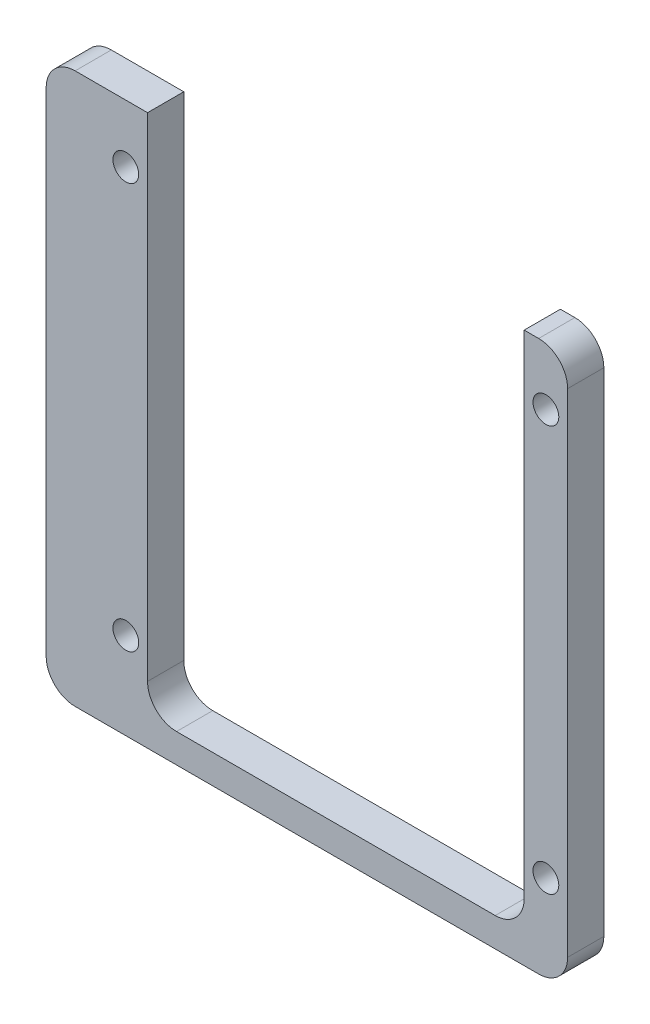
ISO-10303-21;
HEADER;
FILE_DESCRIPTION(('STEP AP214'),'2;1');
FILE_NAME('part.step','',(''),(''),'','','');
FILE_SCHEMA(('AUTOMOTIVE_DESIGN { 1 0 10303 214 1 1 1 1 }'));
ENDSEC;
DATA;
#1=APPLICATION_CONTEXT('core data for automotive mechanical design processes');
#2=APPLICATION_PROTOCOL_DEFINITION('international standard','automotive_design',2000,#1);
#3=PRODUCT_CONTEXT('',#1,'mechanical');
#4=PRODUCT('Part','Part','',(#3));
#5=PRODUCT_RELATED_PRODUCT_CATEGORY('part','',(#4));
#6=PRODUCT_DEFINITION_FORMATION('','',#4);
#7=PRODUCT_DEFINITION_CONTEXT('part definition',#1,'design');
#8=PRODUCT_DEFINITION('design','',#6,#7);
#9=PRODUCT_DEFINITION_SHAPE('','',#8);
#10=(LENGTH_UNIT() NAMED_UNIT(*) SI_UNIT(.MILLI.,.METRE.));
#11=(NAMED_UNIT(*) PLANE_ANGLE_UNIT() SI_UNIT($,.RADIAN.));
#12=(NAMED_UNIT(*) SI_UNIT($,.STERADIAN.) SOLID_ANGLE_UNIT());
#13=UNCERTAINTY_MEASURE_WITH_UNIT(LENGTH_MEASURE(1.E-05),#10,'distance_accuracy_value','');
#14=(GEOMETRIC_REPRESENTATION_CONTEXT(3) GLOBAL_UNCERTAINTY_ASSIGNED_CONTEXT((#13)) GLOBAL_UNIT_ASSIGNED_CONTEXT((#10,
#11,#12)) REPRESENTATION_CONTEXT('',''));
#15=CARTESIAN_POINT('',(0.,0.,0.));
#16=DIRECTION('',(0.,0.,1.));
#17=DIRECTION('',(1.,0.,0.));
#18=AXIS2_PLACEMENT_3D('',#15,#16,#17);
#19=CARTESIAN_POINT('',(-22.86,24.13,3.175));
#20=DIRECTION('',(0.,-1.,0.));
#21=DIRECTION('',(0.,0.,-1.));
#22=AXIS2_PLACEMENT_3D('',#19,#20,#21);
#23=PLANE('',#22);
#24=DIRECTION('',(-1.,0.,0.));
#25=VECTOR('',#24,1.);
#26=CARTESIAN_POINT('',(-22.86,24.13,3.175));
#27=LINE('',#26,#25);
#28=CARTESIAN_POINT('',(20.32,24.13,3.175));
#29=VERTEX_POINT('',#28);
#30=CARTESIAN_POINT('',(19.05,24.13,3.175));
#31=VERTEX_POINT('',#30);
#32=EDGE_CURVE('E191',#29,#31,#27,.T.);
#33=ORIENTED_EDGE('',*,*,#32,.F.);
#34=DIRECTION('',(0.,0.,-1.));
#35=VECTOR('',#34,1.);
#36=CARTESIAN_POINT('',(20.32,24.13,3.175));
#37=LINE('',#36,#35);
#38=CARTESIAN_POINT('',(20.32,24.13,0.));
#39=VERTEX_POINT('',#38);
#40=EDGE_CURVE('E151',#29,#39,#37,.T.);
#41=ORIENTED_EDGE('',*,*,#40,.T.);
#42=DIRECTION('',(-1.,0.,0.));
#43=VECTOR('',#42,1.);
#44=CARTESIAN_POINT('',(-22.86,24.13,0.));
#45=LINE('',#44,#43);
#46=CARTESIAN_POINT('',(19.05,24.13,0.));
#47=VERTEX_POINT('',#46);
#48=EDGE_CURVE('E146',#39,#47,#45,.T.);
#49=ORIENTED_EDGE('',*,*,#48,.T.);
#50=DIRECTION('',(0.,0.,1.));
#51=VECTOR('',#50,1.);
#52=CARTESIAN_POINT('',(19.05,24.13,0.));
#53=LINE('',#52,#51);
#54=EDGE_CURVE('E149',#47,#31,#53,.T.);
#55=ORIENTED_EDGE('',*,*,#54,.T.);
#56=EDGE_LOOP('',(#33,#41,#49,#55));
#57=FACE_BOUND('',#56,.T.);
#58=ADVANCED_FACE('F41',(#57),#23,.F.);
#59=CARTESIAN_POINT('',(22.86,24.13,3.175));
#60=DIRECTION('',(-1.,0.,0.));
#61=DIRECTION('',(0.,-1.,0.));
#62=AXIS2_PLACEMENT_3D('',#59,#60,#61);
#63=PLANE('',#62);
#64=DIRECTION('',(0.,1.,0.));
#65=VECTOR('',#64,1.);
#66=CARTESIAN_POINT('',(22.86,24.13,3.175));
#67=LINE('',#66,#65);
#68=CARTESIAN_POINT('',(22.86,-21.59,3.175));
#69=VERTEX_POINT('',#68);
#70=CARTESIAN_POINT('',(22.86,21.59,3.175));
#71=VERTEX_POINT('',#70);
#72=EDGE_CURVE('E186',#69,#71,#67,.T.);
#73=ORIENTED_EDGE('',*,*,#72,.F.);
#74=DIRECTION('',(0.,0.,-1.));
#75=VECTOR('',#74,1.);
#76=CARTESIAN_POINT('',(22.86,-21.59,3.175));
#77=LINE('',#76,#75);
#78=CARTESIAN_POINT('',(22.86,-21.59,0.));
#79=VERTEX_POINT('',#78);
#80=EDGE_CURVE('E212',#69,#79,#77,.T.);
#81=ORIENTED_EDGE('',*,*,#80,.T.);
#82=DIRECTION('',(0.,1.,0.));
#83=VECTOR('',#82,1.);
#84=CARTESIAN_POINT('',(22.86,24.13,0.));
#85=LINE('',#84,#83);
#86=CARTESIAN_POINT('',(22.86,21.59,0.));
#87=VERTEX_POINT('',#86);
#88=EDGE_CURVE('E181',#79,#87,#85,.T.);
#89=ORIENTED_EDGE('',*,*,#88,.T.);
#90=DIRECTION('',(0.,0.,-1.));
#91=VECTOR('',#90,1.);
#92=CARTESIAN_POINT('',(22.86,21.59,3.175));
#93=LINE('',#92,#91);
#94=EDGE_CURVE('E201',#87,#71,#93,.F.);
#95=ORIENTED_EDGE('',*,*,#94,.T.);
#96=EDGE_LOOP('',(#73,#81,#89,#95));
#97=FACE_BOUND('',#96,.T.);
#98=ADVANCED_FACE('F367',(#97),#63,.F.);
#99=CARTESIAN_POINT('',(-13.97,24.13,0.));
#100=VERTEX_POINT('',#99);
#101=CARTESIAN_POINT('',(-20.32,24.13,0.));
#102=VERTEX_POINT('',#101);
#103=EDGE_CURVE('E155',#100,#102,#45,.T.);
#104=ORIENTED_EDGE('',*,*,#103,.T.);
#105=DIRECTION('',(0.,0.,-1.));
#106=VECTOR('',#105,1.);
#107=CARTESIAN_POINT('',(-20.32,24.13,3.175));
#108=LINE('',#107,#106);
#109=CARTESIAN_POINT('',(-20.32,24.13,3.175));
#110=VERTEX_POINT('',#109);
#111=EDGE_CURVE('E252',#102,#110,#108,.F.);
#112=ORIENTED_EDGE('',*,*,#111,.T.);
#113=CARTESIAN_POINT('',(-13.97,24.13,3.175));
#114=VERTEX_POINT('',#113);
#115=EDGE_CURVE('E189',#114,#110,#27,.T.);
#116=ORIENTED_EDGE('',*,*,#115,.F.);
#117=DIRECTION('',(0.,0.,1.));
#118=VECTOR('',#117,1.);
#119=CARTESIAN_POINT('',(-13.97,24.13,0.));
#120=LINE('',#119,#118);
#121=EDGE_CURVE('E176',#100,#114,#120,.T.);
#122=ORIENTED_EDGE('',*,*,#121,.F.);
#123=EDGE_LOOP('',(#104,#112,#116,#122));
#124=FACE_BOUND('',#123,.T.);
#125=ADVANCED_FACE('F369',(#124),#23,.F.);
#126=CARTESIAN_POINT('',(-22.86,24.13,3.175));
#127=DIRECTION('',(1.,0.,0.));
#128=DIRECTION('',(0.,1.,0.));
#129=AXIS2_PLACEMENT_3D('',#126,#127,#128);
#130=PLANE('',#129);
#131=DIRECTION('',(0.,-1.,0.));
#132=VECTOR('',#131,1.);
#133=CARTESIAN_POINT('',(-22.86,24.13,0.));
#134=LINE('',#133,#132);
#135=CARTESIAN_POINT('',(-22.86,21.59,0.));
#136=VERTEX_POINT('',#135);
#137=CARTESIAN_POINT('',(-22.86,-21.59,0.));
#138=VERTEX_POINT('',#137);
#139=EDGE_CURVE('E154',#136,#138,#134,.T.);
#140=ORIENTED_EDGE('',*,*,#139,.T.);
#141=DIRECTION('',(0.,0.,-1.));
#142=VECTOR('',#141,1.);
#143=CARTESIAN_POINT('',(-22.86,-21.59,3.175));
#144=LINE('',#143,#142);
#145=CARTESIAN_POINT('',(-22.86,-21.59,3.175));
#146=VERTEX_POINT('',#145);
#147=EDGE_CURVE('E65',#138,#146,#144,.F.);
#148=ORIENTED_EDGE('',*,*,#147,.T.);
#149=DIRECTION('',(0.,-1.,0.));
#150=VECTOR('',#149,1.);
#151=CARTESIAN_POINT('',(-22.86,24.13,3.175));
#152=LINE('',#151,#150);
#153=CARTESIAN_POINT('',(-22.86,21.59,3.175));
#154=VERTEX_POINT('',#153);
#155=EDGE_CURVE('E194',#154,#146,#152,.T.);
#156=ORIENTED_EDGE('',*,*,#155,.F.);
#157=DIRECTION('',(0.,0.,-1.));
#158=VECTOR('',#157,1.);
#159=CARTESIAN_POINT('',(-22.86,21.59,3.175));
#160=LINE('',#159,#158);
#161=EDGE_CURVE('E246',#154,#136,#160,.T.);
#162=ORIENTED_EDGE('',*,*,#161,.T.);
#163=EDGE_LOOP('',(#140,#148,#156,#162));
#164=FACE_BOUND('',#163,.T.);
#165=ADVANCED_FACE('F377',(#164),#130,.F.);
#166=CARTESIAN_POINT('',(-22.86,-24.13,3.175));
#167=DIRECTION('',(0.,1.,0.));
#168=DIRECTION('',(0.,0.,1.));
#169=AXIS2_PLACEMENT_3D('',#166,#167,#168);
#170=PLANE('',#169);
#171=DIRECTION('',(1.,0.,0.));
#172=VECTOR('',#171,1.);
#173=CARTESIAN_POINT('',(-22.86,-24.13,0.));
#174=LINE('',#173,#172);
#175=CARTESIAN_POINT('',(-20.32,-24.13,0.));
#176=VERTEX_POINT('',#175);
#177=CARTESIAN_POINT('',(20.32,-24.13,0.));
#178=VERTEX_POINT('',#177);
#179=EDGE_CURVE('E190',#176,#178,#174,.T.);
#180=ORIENTED_EDGE('',*,*,#179,.T.);
#181=DIRECTION('',(0.,0.,-1.));
#182=VECTOR('',#181,1.);
#183=CARTESIAN_POINT('',(20.32,-24.13,3.175));
#184=LINE('',#183,#182);
#185=CARTESIAN_POINT('',(20.32,-24.13,3.175));
#186=VERTEX_POINT('',#185);
#187=EDGE_CURVE('E232',#178,#186,#184,.F.);
#188=ORIENTED_EDGE('',*,*,#187,.T.);
#189=DIRECTION('',(1.,0.,0.));
#190=VECTOR('',#189,1.);
#191=CARTESIAN_POINT('',(-22.86,-24.13,3.175));
#192=LINE('',#191,#190);
#193=CARTESIAN_POINT('',(-20.32,-24.13,3.175));
#194=VERTEX_POINT('',#193);
#195=EDGE_CURVE('E197',#194,#186,#192,.T.);
#196=ORIENTED_EDGE('',*,*,#195,.F.);
#197=DIRECTION('',(0.,0.,-1.));
#198=VECTOR('',#197,1.);
#199=CARTESIAN_POINT('',(-20.32,-24.13,3.175));
#200=LINE('',#199,#198);
#201=EDGE_CURVE('E228',#194,#176,#200,.T.);
#202=ORIENTED_EDGE('',*,*,#201,.T.);
#203=EDGE_LOOP('',(#180,#188,#196,#202));
#204=FACE_BOUND('',#203,.T.);
#205=ADVANCED_FACE('F343',(#204),#170,.F.);
#206=CARTESIAN_POINT('',(0.,0.,3.175));
#207=DIRECTION('',(0.,0.,1.));
#208=DIRECTION('',(1.,0.,0.));
#209=AXIS2_PLACEMENT_3D('',#206,#207,#208);
#210=PLANE('',#209);
#211=CARTESIAN_POINT('',(-15.875,19.05,3.175));
#212=DIRECTION('',(0.,0.,1.));
#213=DIRECTION('',(1.,0.,0.));
#214=AXIS2_PLACEMENT_3D('',#211,#212,#213);
#215=CIRCLE('',#214,1.1303);
#216=CARTESIAN_POINT('',(-14.7447,19.05,3.175));
#217=VERTEX_POINT('',#216);
#218=EDGE_CURVE('E334',#217,#217,#215,.T.);
#219=ORIENTED_EDGE('',*,*,#218,.F.);
#220=EDGE_LOOP('',(#219));
#221=FACE_BOUND('',#220,.T.);
#222=CARTESIAN_POINT('',(-15.875,-16.51,3.175));
#223=DIRECTION('',(0.,0.,1.));
#224=DIRECTION('',(1.,0.,0.));
#225=AXIS2_PLACEMENT_3D('',#222,#223,#224);
#226=CIRCLE('',#225,1.1303);
#227=CARTESIAN_POINT('',(-14.7447,-16.51,3.175));
#228=VERTEX_POINT('',#227);
#229=EDGE_CURVE('E326',#228,#228,#226,.T.);
#230=ORIENTED_EDGE('',*,*,#229,.F.);
#231=EDGE_LOOP('',(#230));
#232=FACE_BOUND('',#231,.T.);
#233=CARTESIAN_POINT('',(20.955,19.05,3.175));
#234=DIRECTION('',(0.,0.,1.));
#235=DIRECTION('',(1.,0.,0.));
#236=AXIS2_PLACEMENT_3D('',#233,#234,#235);
#237=CIRCLE('',#236,1.1303);
#238=CARTESIAN_POINT('',(22.0853,19.05,3.175));
#239=VERTEX_POINT('',#238);
#240=EDGE_CURVE('E318',#239,#239,#237,.T.);
#241=ORIENTED_EDGE('',*,*,#240,.F.);
#242=EDGE_LOOP('',(#241));
#243=FACE_BOUND('',#242,.T.);
#244=CARTESIAN_POINT('',(20.955,-16.51,3.175));
#245=DIRECTION('',(0.,0.,1.));
#246=DIRECTION('',(1.,0.,0.));
#247=AXIS2_PLACEMENT_3D('',#244,#245,#246);
#248=CIRCLE('',#247,1.1303);
#249=CARTESIAN_POINT('',(22.0853,-16.51,3.175));
#250=VERTEX_POINT('',#249);
#251=EDGE_CURVE('E305',#250,#250,#248,.T.);
#252=ORIENTED_EDGE('',*,*,#251,.F.);
#253=EDGE_LOOP('',(#252));
#254=FACE_BOUND('',#253,.T.);
#255=ORIENTED_EDGE('',*,*,#195,.T.);
#256=CARTESIAN_POINT('',(20.32,-21.59,3.175));
#257=DIRECTION('',(0.,0.,1.));
#258=DIRECTION('',(1.,0.,0.));
#259=AXIS2_PLACEMENT_3D('',#256,#257,#258);
#260=CIRCLE('',#259,2.54);
#261=EDGE_CURVE('E243',#186,#69,#260,.T.);
#262=ORIENTED_EDGE('',*,*,#261,.T.);
#263=ORIENTED_EDGE('',*,*,#72,.T.);
#264=CARTESIAN_POINT('',(20.32,21.59,3.175));
#265=DIRECTION('',(0.,0.,1.));
#266=DIRECTION('',(1.,0.,0.));
#267=AXIS2_PLACEMENT_3D('',#264,#265,#266);
#268=CIRCLE('',#267,2.54);
#269=EDGE_CURVE('E57',#71,#29,#268,.T.);
#270=ORIENTED_EDGE('',*,*,#269,.T.);
#271=ORIENTED_EDGE('',*,*,#32,.T.);
#272=DIRECTION('',(0.,1.,0.));
#273=VECTOR('',#272,1.);
#274=CARTESIAN_POINT('',(19.05,24.13,3.175));
#275=LINE('',#274,#273);
#276=CARTESIAN_POINT('',(19.05,-19.05,3.175));
#277=VERTEX_POINT('',#276);
#278=EDGE_CURVE('E174',#277,#31,#275,.T.);
#279=ORIENTED_EDGE('',*,*,#278,.F.);
#280=CARTESIAN_POINT('',(16.51,-19.05,3.175));
#281=DIRECTION('',(0.,0.,1.));
#282=DIRECTION('',(1.,0.,0.));
#283=AXIS2_PLACEMENT_3D('',#280,#281,#282);
#284=CIRCLE('',#283,2.54);
#285=CARTESIAN_POINT('',(16.51,-21.59,3.175));
#286=VERTEX_POINT('',#285);
#287=EDGE_CURVE('E270',#277,#286,#284,.F.);
#288=ORIENTED_EDGE('',*,*,#287,.T.);
#289=DIRECTION('',(1.,0.,0.));
#290=VECTOR('',#289,1.);
#291=CARTESIAN_POINT('',(-13.97,-21.59,3.175));
#292=LINE('',#291,#290);
#293=CARTESIAN_POINT('',(-11.43,-21.59,3.175));
#294=VERTEX_POINT('',#293);
#295=EDGE_CURVE('E169',#294,#286,#292,.T.);
#296=ORIENTED_EDGE('',*,*,#295,.F.);
#297=CARTESIAN_POINT('',(-11.43,-19.05,3.175));
#298=DIRECTION('',(0.,0.,1.));
#299=DIRECTION('',(1.,0.,0.));
#300=AXIS2_PLACEMENT_3D('',#297,#298,#299);
#301=CIRCLE('',#300,2.54);
#302=CARTESIAN_POINT('',(-13.97,-19.05,3.175));
#303=VERTEX_POINT('',#302);
#304=EDGE_CURVE('E50',#294,#303,#301,.F.);
#305=ORIENTED_EDGE('',*,*,#304,.T.);
#306=DIRECTION('',(0.,-1.,0.));
#307=VECTOR('',#306,1.);
#308=CARTESIAN_POINT('',(-13.97,24.13,3.175));
#309=LINE('',#308,#307);
#310=EDGE_CURVE('E280',#114,#303,#309,.T.);
#311=ORIENTED_EDGE('',*,*,#310,.F.);
#312=ORIENTED_EDGE('',*,*,#115,.T.);
#313=CARTESIAN_POINT('',(-20.32,21.59,3.175));
#314=DIRECTION('',(0.,0.,1.));
#315=DIRECTION('',(1.,0.,0.));
#316=AXIS2_PLACEMENT_3D('',#313,#314,#315);
#317=CIRCLE('',#316,2.54);
#318=EDGE_CURVE('E237',#110,#154,#317,.T.);
#319=ORIENTED_EDGE('',*,*,#318,.T.);
#320=ORIENTED_EDGE('',*,*,#155,.T.);
#321=CARTESIAN_POINT('',(-20.32,-21.59,3.175));
#322=DIRECTION('',(0.,0.,1.));
#323=DIRECTION('',(1.,0.,0.));
#324=AXIS2_PLACEMENT_3D('',#321,#322,#323);
#325=CIRCLE('',#324,2.54);
#326=EDGE_CURVE('E240',#146,#194,#325,.T.);
#327=ORIENTED_EDGE('',*,*,#326,.T.);
#328=EDGE_LOOP('',(#255,#262,#263,#270,#271,#279,#288,#296,#305,#311,#312,#319,#320,#327));
#329=FACE_BOUND('',#328,.T.);
#330=ADVANCED_FACE('F278',(#221,#232,#243,#254,#329),#210,.T.);
#331=CARTESIAN_POINT('',(0.,0.,0.));
#332=DIRECTION('',(0.,0.,1.));
#333=DIRECTION('',(1.,0.,0.));
#334=AXIS2_PLACEMENT_3D('',#331,#332,#333);
#335=PLANE('',#334);
#336=CARTESIAN_POINT('',(-15.875,19.05,0.));
#337=DIRECTION('',(0.,0.,1.));
#338=DIRECTION('',(1.,0.,0.));
#339=AXIS2_PLACEMENT_3D('',#336,#337,#338);
#340=CIRCLE('',#339,1.1303);
#341=CARTESIAN_POINT('',(-14.7447,19.05,0.));
#342=VERTEX_POINT('',#341);
#343=EDGE_CURVE('E330',#342,#342,#340,.T.);
#344=ORIENTED_EDGE('',*,*,#343,.T.);
#345=EDGE_LOOP('',(#344));
#346=FACE_BOUND('',#345,.T.);
#347=CARTESIAN_POINT('',(-15.875,-16.51,0.));
#348=DIRECTION('',(0.,0.,1.));
#349=DIRECTION('',(1.,0.,0.));
#350=AXIS2_PLACEMENT_3D('',#347,#348,#349);
#351=CIRCLE('',#350,1.1303);
#352=CARTESIAN_POINT('',(-14.7447,-16.51,0.));
#353=VERTEX_POINT('',#352);
#354=EDGE_CURVE('E322',#353,#353,#351,.T.);
#355=ORIENTED_EDGE('',*,*,#354,.T.);
#356=EDGE_LOOP('',(#355));
#357=FACE_BOUND('',#356,.T.);
#358=CARTESIAN_POINT('',(20.955,19.05,0.));
#359=DIRECTION('',(0.,0.,1.));
#360=DIRECTION('',(1.,0.,0.));
#361=AXIS2_PLACEMENT_3D('',#358,#359,#360);
#362=CIRCLE('',#361,1.1303);
#363=CARTESIAN_POINT('',(22.0853,19.05,0.));
#364=VERTEX_POINT('',#363);
#365=EDGE_CURVE('E314',#364,#364,#362,.T.);
#366=ORIENTED_EDGE('',*,*,#365,.T.);
#367=EDGE_LOOP('',(#366));
#368=FACE_BOUND('',#367,.T.);
#369=CARTESIAN_POINT('',(20.955,-16.51,0.));
#370=DIRECTION('',(0.,0.,1.));
#371=DIRECTION('',(1.,0.,0.));
#372=AXIS2_PLACEMENT_3D('',#369,#370,#371);
#373=CIRCLE('',#372,1.1303);
#374=CARTESIAN_POINT('',(22.0853,-16.51,0.));
#375=VERTEX_POINT('',#374);
#376=EDGE_CURVE('E301',#375,#375,#373,.T.);
#377=ORIENTED_EDGE('',*,*,#376,.T.);
#378=EDGE_LOOP('',(#377));
#379=FACE_BOUND('',#378,.T.);
#380=ORIENTED_EDGE('',*,*,#88,.F.);
#381=CARTESIAN_POINT('',(20.32,-21.59,0.));
#382=DIRECTION('',(0.,0.,1.));
#383=DIRECTION('',(1.,0.,0.));
#384=AXIS2_PLACEMENT_3D('',#381,#382,#383);
#385=CIRCLE('',#384,2.54);
#386=EDGE_CURVE('E225',#79,#178,#385,.F.);
#387=ORIENTED_EDGE('',*,*,#386,.T.);
#388=ORIENTED_EDGE('',*,*,#179,.F.);
#389=CARTESIAN_POINT('',(-20.32,-21.59,0.));
#390=DIRECTION('',(0.,0.,1.));
#391=DIRECTION('',(1.,0.,0.));
#392=AXIS2_PLACEMENT_3D('',#389,#390,#391);
#393=CIRCLE('',#392,2.54);
#394=EDGE_CURVE('E222',#176,#138,#393,.F.);
#395=ORIENTED_EDGE('',*,*,#394,.T.);
#396=ORIENTED_EDGE('',*,*,#139,.F.);
#397=CARTESIAN_POINT('',(-20.32,21.59,0.));
#398=DIRECTION('',(0.,0.,1.));
#399=DIRECTION('',(1.,0.,0.));
#400=AXIS2_PLACEMENT_3D('',#397,#398,#399);
#401=CIRCLE('',#400,2.54);
#402=EDGE_CURVE('E219',#136,#102,#401,.F.);
#403=ORIENTED_EDGE('',*,*,#402,.T.);
#404=ORIENTED_EDGE('',*,*,#103,.F.);
#405=DIRECTION('',(0.,-1.,0.));
#406=VECTOR('',#405,1.);
#407=CARTESIAN_POINT('',(-13.97,24.13,0.));
#408=LINE('',#407,#406);
#409=CARTESIAN_POINT('',(-13.97,-19.05,0.));
#410=VERTEX_POINT('',#409);
#411=EDGE_CURVE('E168',#100,#410,#408,.T.);
#412=ORIENTED_EDGE('',*,*,#411,.T.);
#413=CARTESIAN_POINT('',(-11.43,-19.05,0.));
#414=DIRECTION('',(0.,0.,1.));
#415=DIRECTION('',(1.,0.,0.));
#416=AXIS2_PLACEMENT_3D('',#413,#414,#415);
#417=CIRCLE('',#416,2.54);
#418=CARTESIAN_POINT('',(-11.43,-21.59,0.));
#419=VERTEX_POINT('',#418);
#420=EDGE_CURVE('E11',#410,#419,#417,.T.);
#421=ORIENTED_EDGE('',*,*,#420,.T.);
#422=DIRECTION('',(1.,0.,0.));
#423=VECTOR('',#422,1.);
#424=CARTESIAN_POINT('',(-13.97,-21.59,0.));
#425=LINE('',#424,#423);
#426=CARTESIAN_POINT('',(16.51,-21.59,0.));
#427=VERTEX_POINT('',#426);
#428=EDGE_CURVE('E177',#419,#427,#425,.T.);
#429=ORIENTED_EDGE('',*,*,#428,.T.);
#430=CARTESIAN_POINT('',(16.51,-19.05,0.));
#431=DIRECTION('',(0.,0.,1.));
#432=DIRECTION('',(1.,0.,0.));
#433=AXIS2_PLACEMENT_3D('',#430,#431,#432);
#434=CIRCLE('',#433,2.54);
#435=CARTESIAN_POINT('',(19.05,-19.05,0.));
#436=VERTEX_POINT('',#435);
#437=EDGE_CURVE('E163',#427,#436,#434,.T.);
#438=ORIENTED_EDGE('',*,*,#437,.T.);
#439=DIRECTION('',(0.,1.,0.));
#440=VECTOR('',#439,1.);
#441=CARTESIAN_POINT('',(19.05,24.13,0.));
#442=LINE('',#441,#440);
#443=EDGE_CURVE('E158',#436,#47,#442,.T.);
#444=ORIENTED_EDGE('',*,*,#443,.T.);
#445=ORIENTED_EDGE('',*,*,#48,.F.);
#446=CARTESIAN_POINT('',(20.32,21.59,0.));
#447=DIRECTION('',(0.,0.,1.));
#448=DIRECTION('',(1.,0.,0.));
#449=AXIS2_PLACEMENT_3D('',#446,#447,#448);
#450=CIRCLE('',#449,2.54);
#451=EDGE_CURVE('E216',#39,#87,#450,.F.);
#452=ORIENTED_EDGE('',*,*,#451,.T.);
#453=EDGE_LOOP('',(#380,#387,#388,#395,#396,#403,#404,#412,#421,#429,#438,#444,#445,#452));
#454=FACE_BOUND('',#453,.T.);
#455=ADVANCED_FACE('F160',(#346,#357,#368,#379,#454),#335,.F.);
#456=CARTESIAN_POINT('',(19.05,24.13,0.));
#457=DIRECTION('',(1.,0.,0.));
#458=DIRECTION('',(0.,1.,0.));
#459=AXIS2_PLACEMENT_3D('',#456,#457,#458);
#460=PLANE('',#459);
#461=ORIENTED_EDGE('',*,*,#443,.F.);
#462=DIRECTION('',(0.,0.,1.));
#463=VECTOR('',#462,1.);
#464=CARTESIAN_POINT('',(19.05,-19.05,3.175));
#465=LINE('',#464,#463);
#466=EDGE_CURVE('E257',#436,#277,#465,.T.);
#467=ORIENTED_EDGE('',*,*,#466,.T.);
#468=ORIENTED_EDGE('',*,*,#278,.T.);
#469=ORIENTED_EDGE('',*,*,#54,.F.);
#470=EDGE_LOOP('',(#461,#467,#468,#469));
#471=FACE_BOUND('',#470,.T.);
#472=ADVANCED_FACE('F172',(#471),#460,.F.);
#473=CARTESIAN_POINT('',(-13.97,-21.59,0.));
#474=DIRECTION('',(0.,-1.,0.));
#475=DIRECTION('',(0.,0.,-1.));
#476=AXIS2_PLACEMENT_3D('',#473,#474,#475);
#477=PLANE('',#476);
#478=ORIENTED_EDGE('',*,*,#295,.T.);
#479=DIRECTION('',(0.,0.,1.));
#480=VECTOR('',#479,1.);
#481=CARTESIAN_POINT('',(16.51,-21.59,0.));
#482=LINE('',#481,#480);
#483=EDGE_CURVE('E264',#286,#427,#482,.F.);
#484=ORIENTED_EDGE('',*,*,#483,.T.);
#485=ORIENTED_EDGE('',*,*,#428,.F.);
#486=DIRECTION('',(0.,0.,1.));
#487=VECTOR('',#486,1.);
#488=CARTESIAN_POINT('',(-11.43,-21.59,3.175));
#489=LINE('',#488,#487);
#490=EDGE_CURVE('E260',#419,#294,#489,.T.);
#491=ORIENTED_EDGE('',*,*,#490,.T.);
#492=EDGE_LOOP('',(#478,#484,#485,#491));
#493=FACE_BOUND('',#492,.T.);
#494=ADVANCED_FACE('F296',(#493),#477,.F.);
#495=CARTESIAN_POINT('',(-13.97,24.13,0.));
#496=DIRECTION('',(-1.,0.,0.));
#497=DIRECTION('',(0.,-1.,0.));
#498=AXIS2_PLACEMENT_3D('',#495,#496,#497);
#499=PLANE('',#498);
#500=ORIENTED_EDGE('',*,*,#310,.T.);
#501=DIRECTION('',(0.,0.,1.));
#502=VECTOR('',#501,1.);
#503=CARTESIAN_POINT('',(-13.97,-19.05,0.));
#504=LINE('',#503,#502);
#505=EDGE_CURVE('E267',#303,#410,#504,.F.);
#506=ORIENTED_EDGE('',*,*,#505,.T.);
#507=ORIENTED_EDGE('',*,*,#411,.F.);
#508=ORIENTED_EDGE('',*,*,#121,.T.);
#509=EDGE_LOOP('',(#500,#506,#507,#508));
#510=FACE_BOUND('',#509,.T.);
#511=ADVANCED_FACE('F287',(#510),#499,.F.);
#512=CARTESIAN_POINT('',(20.955,-16.51,3.175));
#513=DIRECTION('',(0.,0.,1.));
#514=DIRECTION('',(1.,0.,0.));
#515=AXIS2_PLACEMENT_3D('',#512,#513,#514);
#516=CYLINDRICAL_SURFACE('',#515,1.1303);
#517=ORIENTED_EDGE('',*,*,#376,.F.);
#518=EDGE_LOOP('',(#517));
#519=FACE_BOUND('',#518,.T.);
#520=ORIENTED_EDGE('',*,*,#251,.T.);
#521=EDGE_LOOP('',(#520));
#522=FACE_BOUND('',#521,.T.);
#523=ADVANCED_FACE('F351',(#519,#522),#516,.F.);
#524=CARTESIAN_POINT('',(20.955,19.05,3.175));
#525=DIRECTION('',(0.,0.,1.));
#526=DIRECTION('',(1.,0.,0.));
#527=AXIS2_PLACEMENT_3D('',#524,#525,#526);
#528=CYLINDRICAL_SURFACE('',#527,1.1303);
#529=ORIENTED_EDGE('',*,*,#365,.F.);
#530=EDGE_LOOP('',(#529));
#531=FACE_BOUND('',#530,.T.);
#532=ORIENTED_EDGE('',*,*,#240,.T.);
#533=EDGE_LOOP('',(#532));
#534=FACE_BOUND('',#533,.T.);
#535=ADVANCED_FACE('F353',(#531,#534),#528,.F.);
#536=CARTESIAN_POINT('',(-15.875,-16.51,3.175));
#537=DIRECTION('',(0.,0.,1.));
#538=DIRECTION('',(1.,0.,0.));
#539=AXIS2_PLACEMENT_3D('',#536,#537,#538);
#540=CYLINDRICAL_SURFACE('',#539,1.1303);
#541=ORIENTED_EDGE('',*,*,#354,.F.);
#542=EDGE_LOOP('',(#541));
#543=FACE_BOUND('',#542,.T.);
#544=ORIENTED_EDGE('',*,*,#229,.T.);
#545=EDGE_LOOP('',(#544));
#546=FACE_BOUND('',#545,.T.);
#547=ADVANCED_FACE('F360',(#543,#546),#540,.F.);
#548=CARTESIAN_POINT('',(-15.875,19.05,3.175));
#549=DIRECTION('',(0.,0.,1.));
#550=DIRECTION('',(1.,0.,0.));
#551=AXIS2_PLACEMENT_3D('',#548,#549,#550);
#552=CYLINDRICAL_SURFACE('',#551,1.1303);
#553=ORIENTED_EDGE('',*,*,#343,.F.);
#554=EDGE_LOOP('',(#553));
#555=FACE_BOUND('',#554,.T.);
#556=ORIENTED_EDGE('',*,*,#218,.T.);
#557=EDGE_LOOP('',(#556));
#558=FACE_BOUND('',#557,.T.);
#559=ADVANCED_FACE('F339',(#555,#558),#552,.F.);
#560=CARTESIAN_POINT('',(20.32,-21.59,3.175));
#561=DIRECTION('',(0.,0.,-1.));
#562=DIRECTION('',(-1.,0.,0.));
#563=AXIS2_PLACEMENT_3D('',#560,#561,#562);
#564=CYLINDRICAL_SURFACE('',#563,2.54);
#565=ORIENTED_EDGE('',*,*,#261,.F.);
#566=ORIENTED_EDGE('',*,*,#187,.F.);
#567=ORIENTED_EDGE('',*,*,#386,.F.);
#568=ORIENTED_EDGE('',*,*,#80,.F.);
#569=EDGE_LOOP('',(#565,#566,#567,#568));
#570=FACE_BOUND('',#569,.T.);
#571=ADVANCED_FACE('F402',(#570),#564,.T.);
#572=CARTESIAN_POINT('',(-20.32,-21.59,3.175));
#573=DIRECTION('',(0.,0.,-1.));
#574=DIRECTION('',(-1.,0.,0.));
#575=AXIS2_PLACEMENT_3D('',#572,#573,#574);
#576=CYLINDRICAL_SURFACE('',#575,2.54);
#577=ORIENTED_EDGE('',*,*,#326,.F.);
#578=ORIENTED_EDGE('',*,*,#147,.F.);
#579=ORIENTED_EDGE('',*,*,#394,.F.);
#580=ORIENTED_EDGE('',*,*,#201,.F.);
#581=EDGE_LOOP('',(#577,#578,#579,#580));
#582=FACE_BOUND('',#581,.T.);
#583=ADVANCED_FACE('F394',(#582),#576,.T.);
#584=CARTESIAN_POINT('',(-20.32,21.59,3.175));
#585=DIRECTION('',(0.,0.,-1.));
#586=DIRECTION('',(-1.,0.,0.));
#587=AXIS2_PLACEMENT_3D('',#584,#585,#586);
#588=CYLINDRICAL_SURFACE('',#587,2.54);
#589=ORIENTED_EDGE('',*,*,#318,.F.);
#590=ORIENTED_EDGE('',*,*,#111,.F.);
#591=ORIENTED_EDGE('',*,*,#402,.F.);
#592=ORIENTED_EDGE('',*,*,#161,.F.);
#593=EDGE_LOOP('',(#589,#590,#591,#592));
#594=FACE_BOUND('',#593,.T.);
#595=ADVANCED_FACE('F387',(#594),#588,.T.);
#596=CARTESIAN_POINT('',(20.32,21.59,3.175));
#597=DIRECTION('',(0.,0.,-1.));
#598=DIRECTION('',(-1.,0.,0.));
#599=AXIS2_PLACEMENT_3D('',#596,#597,#598);
#600=CYLINDRICAL_SURFACE('',#599,2.54);
#601=ORIENTED_EDGE('',*,*,#269,.F.);
#602=ORIENTED_EDGE('',*,*,#94,.F.);
#603=ORIENTED_EDGE('',*,*,#451,.F.);
#604=ORIENTED_EDGE('',*,*,#40,.F.);
#605=EDGE_LOOP('',(#601,#602,#603,#604));
#606=FACE_BOUND('',#605,.T.);
#607=ADVANCED_FACE('F405',(#606),#600,.T.);
#608=CARTESIAN_POINT('',(16.51,-19.05,0.));
#609=DIRECTION('',(0.,0.,-1.));
#610=DIRECTION('',(-1.,0.,0.));
#611=AXIS2_PLACEMENT_3D('',#608,#609,#610);
#612=CYLINDRICAL_SURFACE('',#611,2.54);
#613=ORIENTED_EDGE('',*,*,#437,.F.);
#614=ORIENTED_EDGE('',*,*,#483,.F.);
#615=ORIENTED_EDGE('',*,*,#287,.F.);
#616=ORIENTED_EDGE('',*,*,#466,.F.);
#617=EDGE_LOOP('',(#613,#614,#615,#616));
#618=FACE_BOUND('',#617,.T.);
#619=ADVANCED_FACE('F299',(#618),#612,.F.);
#620=CARTESIAN_POINT('',(-11.43,-19.05,0.));
#621=DIRECTION('',(0.,0.,-1.));
#622=DIRECTION('',(-1.,0.,0.));
#623=AXIS2_PLACEMENT_3D('',#620,#621,#622);
#624=CYLINDRICAL_SURFACE('',#623,2.54);
#625=ORIENTED_EDGE('',*,*,#420,.F.);
#626=ORIENTED_EDGE('',*,*,#505,.F.);
#627=ORIENTED_EDGE('',*,*,#304,.F.);
#628=ORIENTED_EDGE('',*,*,#490,.F.);
#629=EDGE_LOOP('',(#625,#626,#627,#628));
#630=FACE_BOUND('',#629,.T.);
#631=ADVANCED_FACE('F43',(#630),#624,.F.);
#632=CLOSED_SHELL('',(#58,#98,#125,#165,#205,#330,#455,#472,#494,#511,#523,#535,#547,#559,#571,
#583,#595,#607,#619,#631));
#633=MANIFOLD_SOLID_BREP('B2',#632);
#634=ADVANCED_BREP_SHAPE_REPRESENTATION('',(#18,#633),#14);
#635=SHAPE_DEFINITION_REPRESENTATION(#9,#634);
ENDSEC;
END-ISO-10303-21;
